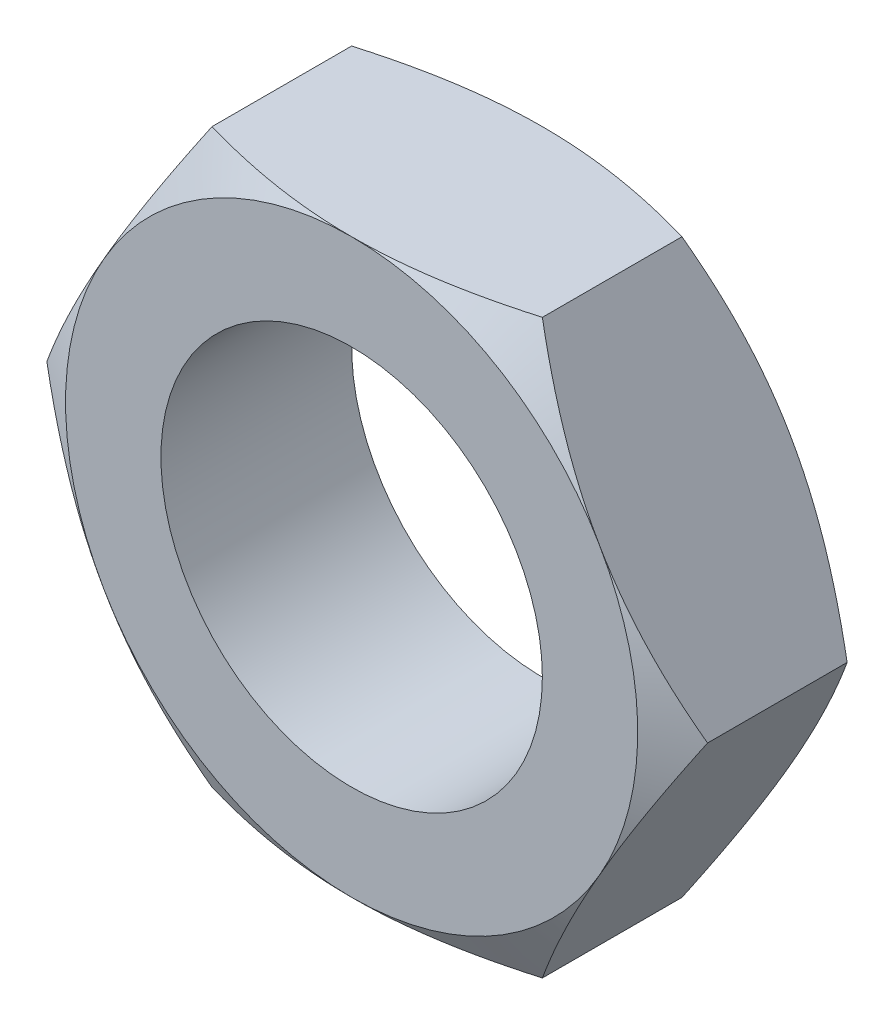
from build123d import *

# Parameters (mm, degrees)
SKETCH1_R      = 8
EXTRUDE1_DEPTH = 4


with BuildPart() as part:
    # Sketch1 → Extrude1 (new, symmetric)
    with BuildSketch(Plane.XY):
        Polygon((6.92820323, 12), (-6.92820323, 12), (-13.856406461, 0), (-6.92820323, -12), (6.92820323, -12), (13.856406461, 0), align=None)
        Circle(SKETCH1_R, mode=Mode.SUBTRACT)
    extrude(amount=EXTRUDE1_DEPTH, both=True)

    # Sketch2 → Cut-Revolve1 (revolve, cut)
    with BuildSketch(Plane(origin=(0, 0, 0), x_dir=(0, 0, -1), z_dir=(1, 0, 0))):
        Polygon((-4, 12), (-4, 24), (2.92820323, 24), align=None)
    cut_revolve1 = revolve(axis=Axis((0, 0, 4), (0, 0, -1)), mode=Mode.SUBTRACT)

    # Mirror1: Cut-Revolve1 across plane
    add(cut_revolve1.mirror(Plane.XY), mode=Mode.SUBTRACT)


solid = part.part
